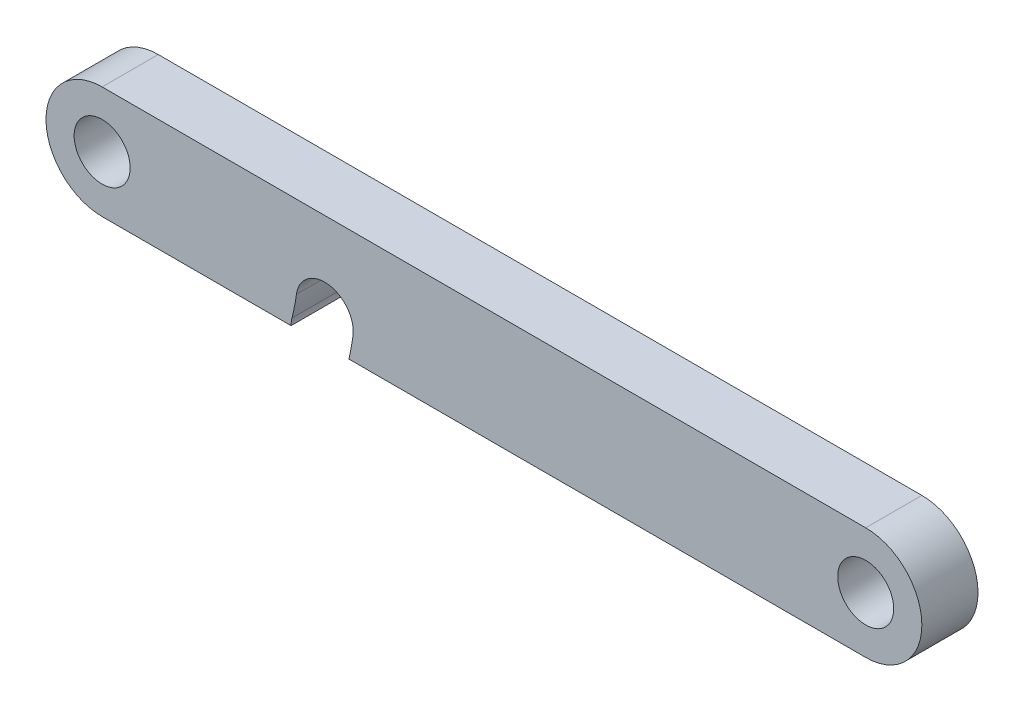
ISO-10303-21;
HEADER;
FILE_DESCRIPTION(('STEP AP214'),'2;1');
FILE_NAME('part.step','',(''),(''),'','','');
FILE_SCHEMA(('AUTOMOTIVE_DESIGN { 1 0 10303 214 1 1 1 1 }'));
ENDSEC;
DATA;
#1=APPLICATION_CONTEXT('core data for automotive mechanical design processes');
#2=APPLICATION_PROTOCOL_DEFINITION('international standard','automotive_design',2000,#1);
#3=PRODUCT_CONTEXT('',#1,'mechanical');
#4=PRODUCT('Part','Part','',(#3));
#5=PRODUCT_RELATED_PRODUCT_CATEGORY('part','',(#4));
#6=PRODUCT_DEFINITION_FORMATION('','',#4);
#7=PRODUCT_DEFINITION_CONTEXT('part definition',#1,'design');
#8=PRODUCT_DEFINITION('design','',#6,#7);
#9=PRODUCT_DEFINITION_SHAPE('','',#8);
#10=(LENGTH_UNIT() NAMED_UNIT(*) SI_UNIT(.MILLI.,.METRE.));
#11=(NAMED_UNIT(*) PLANE_ANGLE_UNIT() SI_UNIT($,.RADIAN.));
#12=(NAMED_UNIT(*) SI_UNIT($,.STERADIAN.) SOLID_ANGLE_UNIT());
#13=UNCERTAINTY_MEASURE_WITH_UNIT(LENGTH_MEASURE(1.E-05),#10,'distance_accuracy_value','');
#14=(GEOMETRIC_REPRESENTATION_CONTEXT(3) GLOBAL_UNCERTAINTY_ASSIGNED_CONTEXT((#13)) GLOBAL_UNIT_ASSIGNED_CONTEXT((#10,
#11,#12)) REPRESENTATION_CONTEXT('',''));
#15=CARTESIAN_POINT('',(0.,0.,0.));
#16=DIRECTION('',(0.,0.,1.));
#17=DIRECTION('',(1.,0.,0.));
#18=AXIS2_PLACEMENT_3D('',#15,#16,#17);
#19=CARTESIAN_POINT('',(-21.59,-3.175,1.5875));
#20=DIRECTION('',(0.,1.,0.));
#21=DIRECTION('',(0.,0.,1.));
#22=AXIS2_PLACEMENT_3D('',#19,#20,#21);
#23=PLANE('',#22);
#24=DIRECTION('',(1.,0.,0.));
#25=VECTOR('',#24,1.);
#26=CARTESIAN_POINT('',(-21.59,-3.175,-1.5875));
#27=LINE('',#26,#25);
#28=CARTESIAN_POINT('',(-21.59,-3.175,-1.5875));
#29=VERTEX_POINT('',#28);
#30=CARTESIAN_POINT('',(-10.9061778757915,-3.175,-1.5875));
#31=VERTEX_POINT('',#30);
#32=EDGE_CURVE('E178',#29,#31,#27,.T.);
#33=ORIENTED_EDGE('',*,*,#32,.T.);
#34=DIRECTION('',(0.,0.,1.));
#35=VECTOR('',#34,1.);
#36=CARTESIAN_POINT('',(-10.9061778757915,-3.175,-1.5875));
#37=LINE('',#36,#35);
#38=CARTESIAN_POINT('',(-10.9061778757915,-3.175,1.5875));
#39=VERTEX_POINT('',#38);
#40=EDGE_CURVE('E11',#31,#39,#37,.T.);
#41=ORIENTED_EDGE('',*,*,#40,.T.);
#42=DIRECTION('',(1.,0.,0.));
#43=VECTOR('',#42,1.);
#44=CARTESIAN_POINT('',(-21.59,-3.175,1.5875));
#45=LINE('',#44,#43);
#46=CARTESIAN_POINT('',(-21.59,-3.175,1.5875));
#47=VERTEX_POINT('',#46);
#48=EDGE_CURVE('E89',#47,#39,#45,.T.);
#49=ORIENTED_EDGE('',*,*,#48,.F.);
#50=DIRECTION('',(0.,0.,-1.));
#51=VECTOR('',#50,1.);
#52=CARTESIAN_POINT('',(-21.59,-3.175,1.5875));
#53=LINE('',#52,#51);
#54=EDGE_CURVE('E190',#47,#29,#53,.T.);
#55=ORIENTED_EDGE('',*,*,#54,.T.);
#56=EDGE_LOOP('',(#33,#41,#49,#55));
#57=FACE_BOUND('',#56,.T.);
#58=ADVANCED_FACE('F37',(#57),#23,.F.);
#59=CARTESIAN_POINT('',(-21.59,0.,1.5875));
#60=DIRECTION('',(0.,0.,1.));
#61=DIRECTION('',(1.,0.,0.));
#62=AXIS2_PLACEMENT_3D('',#59,#60,#61);
#63=PLANE('',#62);
#64=CARTESIAN_POINT('',(-9.29327787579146,-3.175,1.5875));
#65=DIRECTION('',(0.,0.,1.));
#66=DIRECTION('',(1.,0.,0.));
#67=AXIS2_PLACEMENT_3D('',#64,#65,#66);
#68=CIRCLE('',#67,1.6129);
#69=CARTESIAN_POINT('',(-10.8549615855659,-2.771775,1.5875));
#70=VERTEX_POINT('',#69);
#71=EDGE_CURVE('E124',#70,#39,#68,.T.);
#72=ORIENTED_EDGE('',*,*,#71,.F.);
#73=CARTESIAN_POINT('',(-21.59,0.,1.5875));
#74=DIRECTION('',(0.,0.,-1.));
#75=DIRECTION('',(1.,0.,0.));
#76=AXIS2_PLACEMENT_3D('',#73,#74,#75);
#77=CIRCLE('',#76,11.0871);
#78=CARTESIAN_POINT('',(-10.6030472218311,-1.48682717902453,1.5875));
#79=VERTEX_POINT('',#78);
#80=EDGE_CURVE('E139',#79,#70,#77,.T.);
#81=ORIENTED_EDGE('',*,*,#80,.F.);
#82=CARTESIAN_POINT('',(-9.0047161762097,-1.7031239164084,1.5875));
#83=DIRECTION('',(0.,0.,1.));
#84=DIRECTION('',(1.,0.,0.));
#85=AXIS2_PLACEMENT_3D('',#82,#83,#84);
#86=CIRCLE('',#85,1.6129);
#87=CARTESIAN_POINT('',(-7.40638513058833,-1.91942065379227,1.5875));
#88=VERTEX_POINT('',#87);
#89=EDGE_CURVE('E123',#88,#79,#86,.T.);
#90=ORIENTED_EDGE('',*,*,#89,.F.);
#91=CARTESIAN_POINT('',(-21.59,0.,1.5875));
#92=DIRECTION('',(0.,0.,1.));
#93=DIRECTION('',(1.,0.,0.));
#94=AXIS2_PLACEMENT_3D('',#91,#92,#93);
#95=CIRCLE('',#94,14.3129);
#96=CARTESIAN_POINT('',(-7.63369384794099,-3.175,1.5875));
#97=VERTEX_POINT('',#96);
#98=EDGE_CURVE('E116',#97,#88,#95,.T.);
#99=ORIENTED_EDGE('',*,*,#98,.F.);
#100=CARTESIAN_POINT('',(21.59,-3.17499999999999,1.5875));
#101=VERTEX_POINT('',#100);
#102=EDGE_CURVE('E169',#97,#101,#45,.T.);
#103=ORIENTED_EDGE('',*,*,#102,.T.);
#104=CARTESIAN_POINT('',(21.59,0.,1.5875));
#105=DIRECTION('',(0.,0.,1.));
#106=DIRECTION('',(1.,0.,0.));
#107=AXIS2_PLACEMENT_3D('',#104,#105,#106);
#108=CIRCLE('',#107,3.175);
#109=CARTESIAN_POINT('',(21.59,3.175,1.5875));
#110=VERTEX_POINT('',#109);
#111=EDGE_CURVE('E171',#101,#110,#108,.T.);
#112=ORIENTED_EDGE('',*,*,#111,.T.);
#113=DIRECTION('',(-1.,0.,0.));
#114=VECTOR('',#113,1.);
#115=CARTESIAN_POINT('',(-21.59,3.175,1.5875));
#116=LINE('',#115,#114);
#117=CARTESIAN_POINT('',(-21.59,3.175,1.5875));
#118=VERTEX_POINT('',#117);
#119=EDGE_CURVE('E61',#110,#118,#116,.T.);
#120=ORIENTED_EDGE('',*,*,#119,.T.);
#121=CARTESIAN_POINT('',(-21.59,0.,1.5875));
#122=DIRECTION('',(0.,0.,1.));
#123=DIRECTION('',(1.,0.,0.));
#124=AXIS2_PLACEMENT_3D('',#121,#122,#123);
#125=CIRCLE('',#124,3.175);
#126=EDGE_CURVE('E167',#118,#47,#125,.T.);
#127=ORIENTED_EDGE('',*,*,#126,.T.);
#128=ORIENTED_EDGE('',*,*,#48,.T.);
#129=EDGE_LOOP('',(#72,#81,#90,#99,#103,#112,#120,#127,#128));
#130=FACE_BOUND('',#129,.T.);
#131=CARTESIAN_POINT('',(21.59,0.,1.5875));
#132=DIRECTION('',(0.,0.,1.));
#133=DIRECTION('',(1.,0.,0.));
#134=AXIS2_PLACEMENT_3D('',#131,#132,#133);
#135=CIRCLE('',#134,1.584200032);
#136=CARTESIAN_POINT('',(23.174200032,0.,1.5875));
#137=VERTEX_POINT('',#136);
#138=EDGE_CURVE('E161',#137,#137,#135,.T.);
#139=ORIENTED_EDGE('',*,*,#138,.F.);
#140=EDGE_LOOP('',(#139));
#141=FACE_BOUND('',#140,.T.);
#142=CARTESIAN_POINT('',(-21.59,0.,1.5875));
#143=DIRECTION('',(0.,0.,1.));
#144=DIRECTION('',(1.,0.,0.));
#145=AXIS2_PLACEMENT_3D('',#142,#143,#144);
#146=CIRCLE('',#145,1.584200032);
#147=CARTESIAN_POINT('',(-20.005799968,0.,1.5875));
#148=VERTEX_POINT('',#147);
#149=EDGE_CURVE('E155',#148,#148,#146,.T.);
#150=ORIENTED_EDGE('',*,*,#149,.F.);
#151=EDGE_LOOP('',(#150));
#152=FACE_BOUND('',#151,.T.);
#153=ADVANCED_FACE('F136',(#130,#141,#152),#63,.T.);
#154=CARTESIAN_POINT('',(-21.59,0.,-1.5875));
#155=DIRECTION('',(0.,0.,1.));
#156=DIRECTION('',(1.,0.,0.));
#157=AXIS2_PLACEMENT_3D('',#154,#155,#156);
#158=PLANE('',#157);
#159=CARTESIAN_POINT('',(-21.59,0.,-1.5875));
#160=DIRECTION('',(0.,0.,-1.));
#161=DIRECTION('',(1.,0.,0.));
#162=AXIS2_PLACEMENT_3D('',#159,#160,#161);
#163=CIRCLE('',#162,11.0871);
#164=CARTESIAN_POINT('',(-10.6030472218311,-1.48682717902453,-1.5875));
#165=VERTEX_POINT('',#164);
#166=CARTESIAN_POINT('',(-10.8549615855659,-2.771775,-1.5875));
#167=VERTEX_POINT('',#166);
#168=EDGE_CURVE('E133',#165,#167,#163,.T.);
#169=ORIENTED_EDGE('',*,*,#168,.T.);
#170=CARTESIAN_POINT('',(-9.29327787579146,-3.175,-1.5875));
#171=DIRECTION('',(0.,0.,1.));
#172=DIRECTION('',(1.,0.,0.));
#173=AXIS2_PLACEMENT_3D('',#170,#171,#172);
#174=CIRCLE('',#173,1.6129);
#175=EDGE_CURVE('E141',#167,#31,#174,.T.);
#176=ORIENTED_EDGE('',*,*,#175,.T.);
#177=ORIENTED_EDGE('',*,*,#32,.F.);
#178=CARTESIAN_POINT('',(-21.59,0.,-1.5875));
#179=DIRECTION('',(0.,0.,1.));
#180=DIRECTION('',(1.,0.,0.));
#181=AXIS2_PLACEMENT_3D('',#178,#179,#180);
#182=CIRCLE('',#181,3.175);
#183=CARTESIAN_POINT('',(-21.59,3.175,-1.5875));
#184=VERTEX_POINT('',#183);
#185=EDGE_CURVE('E164',#184,#29,#182,.T.);
#186=ORIENTED_EDGE('',*,*,#185,.F.);
#187=DIRECTION('',(-1.,0.,0.));
#188=VECTOR('',#187,1.);
#189=CARTESIAN_POINT('',(-21.59,3.175,-1.5875));
#190=LINE('',#189,#188);
#191=CARTESIAN_POINT('',(21.59,3.175,-1.5875));
#192=VERTEX_POINT('',#191);
#193=EDGE_CURVE('E82',#192,#184,#190,.T.);
#194=ORIENTED_EDGE('',*,*,#193,.F.);
#195=CARTESIAN_POINT('',(21.59,0.,-1.5875));
#196=DIRECTION('',(0.,0.,1.));
#197=DIRECTION('',(1.,0.,0.));
#198=AXIS2_PLACEMENT_3D('',#195,#196,#197);
#199=CIRCLE('',#198,3.175);
#200=CARTESIAN_POINT('',(21.59,-3.17499999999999,-1.5875));
#201=VERTEX_POINT('',#200);
#202=EDGE_CURVE('E181',#201,#192,#199,.T.);
#203=ORIENTED_EDGE('',*,*,#202,.F.);
#204=CARTESIAN_POINT('',(-7.63369384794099,-3.175,-1.5875));
#205=VERTEX_POINT('',#204);
#206=EDGE_CURVE('E177',#205,#201,#27,.T.);
#207=ORIENTED_EDGE('',*,*,#206,.F.);
#208=CARTESIAN_POINT('',(-21.59,0.,-1.5875));
#209=DIRECTION('',(0.,0.,1.));
#210=DIRECTION('',(1.,0.,0.));
#211=AXIS2_PLACEMENT_3D('',#208,#209,#210);
#212=CIRCLE('',#211,14.3129);
#213=CARTESIAN_POINT('',(-7.40638513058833,-1.91942065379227,-1.5875));
#214=VERTEX_POINT('',#213);
#215=EDGE_CURVE('E52',#205,#214,#212,.T.);
#216=ORIENTED_EDGE('',*,*,#215,.T.);
#217=CARTESIAN_POINT('',(-9.0047161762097,-1.7031239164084,-1.5875));
#218=DIRECTION('',(0.,0.,1.));
#219=DIRECTION('',(1.,0.,0.));
#220=AXIS2_PLACEMENT_3D('',#217,#218,#219);
#221=CIRCLE('',#220,1.6129);
#222=EDGE_CURVE('E131',#214,#165,#221,.T.);
#223=ORIENTED_EDGE('',*,*,#222,.T.);
#224=EDGE_LOOP('',(#169,#176,#177,#186,#194,#203,#207,#216,#223));
#225=FACE_BOUND('',#224,.T.);
#226=CARTESIAN_POINT('',(21.59,0.,-1.5875));
#227=DIRECTION('',(0.,0.,1.));
#228=DIRECTION('',(1.,0.,0.));
#229=AXIS2_PLACEMENT_3D('',#226,#227,#228);
#230=CIRCLE('',#229,1.584200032);
#231=CARTESIAN_POINT('',(23.174200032,0.,-1.5875));
#232=VERTEX_POINT('',#231);
#233=EDGE_CURVE('E158',#232,#232,#230,.T.);
#234=ORIENTED_EDGE('',*,*,#233,.T.);
#235=EDGE_LOOP('',(#234));
#236=FACE_BOUND('',#235,.T.);
#237=CARTESIAN_POINT('',(-21.59,0.,-1.5875));
#238=DIRECTION('',(0.,0.,1.));
#239=DIRECTION('',(1.,0.,0.));
#240=AXIS2_PLACEMENT_3D('',#237,#238,#239);
#241=CIRCLE('',#240,1.584200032);
#242=CARTESIAN_POINT('',(-20.005799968,0.,-1.5875));
#243=VERTEX_POINT('',#242);
#244=EDGE_CURVE('E153',#243,#243,#241,.T.);
#245=ORIENTED_EDGE('',*,*,#244,.T.);
#246=EDGE_LOOP('',(#245));
#247=FACE_BOUND('',#246,.T.);
#248=ADVANCED_FACE('F197',(#225,#236,#247),#158,.F.);
#249=CARTESIAN_POINT('',(-21.59,0.,1.5875));
#250=DIRECTION('',(0.,0.,-1.));
#251=DIRECTION('',(-1.,0.,0.));
#252=AXIS2_PLACEMENT_3D('',#249,#250,#251);
#253=CYLINDRICAL_SURFACE('',#252,3.175);
#254=ORIENTED_EDGE('',*,*,#185,.T.);
#255=ORIENTED_EDGE('',*,*,#54,.F.);
#256=ORIENTED_EDGE('',*,*,#126,.F.);
#257=DIRECTION('',(0.,0.,-1.));
#258=VECTOR('',#257,1.);
#259=CARTESIAN_POINT('',(-21.59,3.175,1.5875));
#260=LINE('',#259,#258);
#261=EDGE_CURVE('E174',#118,#184,#260,.T.);
#262=ORIENTED_EDGE('',*,*,#261,.T.);
#263=EDGE_LOOP('',(#254,#255,#256,#262));
#264=FACE_BOUND('',#263,.T.);
#265=ADVANCED_FACE('F39',(#264),#253,.T.);
#266=ORIENTED_EDGE('',*,*,#102,.F.);
#267=DIRECTION('',(0.,0.,1.));
#268=VECTOR('',#267,1.);
#269=CARTESIAN_POINT('',(-7.63369384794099,-3.175,-1.5875));
#270=LINE('',#269,#268);
#271=EDGE_CURVE('E45',#97,#205,#270,.F.);
#272=ORIENTED_EDGE('',*,*,#271,.T.);
#273=ORIENTED_EDGE('',*,*,#206,.T.);
#274=DIRECTION('',(0.,0.,-1.));
#275=VECTOR('',#274,1.);
#276=CARTESIAN_POINT('',(21.59,-3.17499999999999,1.5875));
#277=LINE('',#276,#275);
#278=EDGE_CURVE('E187',#101,#201,#277,.T.);
#279=ORIENTED_EDGE('',*,*,#278,.F.);
#280=EDGE_LOOP('',(#266,#272,#273,#279));
#281=FACE_BOUND('',#280,.T.);
#282=ADVANCED_FACE('F193',(#281),#23,.F.);
#283=CARTESIAN_POINT('',(21.59,0.,1.5875));
#284=DIRECTION('',(0.,0.,-1.));
#285=DIRECTION('',(-1.,0.,0.));
#286=AXIS2_PLACEMENT_3D('',#283,#284,#285);
#287=CYLINDRICAL_SURFACE('',#286,3.175);
#288=ORIENTED_EDGE('',*,*,#202,.T.);
#289=DIRECTION('',(0.,0.,-1.));
#290=VECTOR('',#289,1.);
#291=CARTESIAN_POINT('',(21.59,3.175,1.5875));
#292=LINE('',#291,#290);
#293=EDGE_CURVE('E185',#110,#192,#292,.T.);
#294=ORIENTED_EDGE('',*,*,#293,.F.);
#295=ORIENTED_EDGE('',*,*,#111,.F.);
#296=ORIENTED_EDGE('',*,*,#278,.T.);
#297=EDGE_LOOP('',(#288,#294,#295,#296));
#298=FACE_BOUND('',#297,.T.);
#299=ADVANCED_FACE('F202',(#298),#287,.T.);
#300=CARTESIAN_POINT('',(-21.59,3.175,1.5875));
#301=DIRECTION('',(0.,-1.,0.));
#302=DIRECTION('',(0.,0.,-1.));
#303=AXIS2_PLACEMENT_3D('',#300,#301,#302);
#304=PLANE('',#303);
#305=ORIENTED_EDGE('',*,*,#193,.T.);
#306=ORIENTED_EDGE('',*,*,#261,.F.);
#307=ORIENTED_EDGE('',*,*,#119,.F.);
#308=ORIENTED_EDGE('',*,*,#293,.T.);
#309=EDGE_LOOP('',(#305,#306,#307,#308));
#310=FACE_BOUND('',#309,.T.);
#311=ADVANCED_FACE('F204',(#310),#304,.F.);
#312=CARTESIAN_POINT('',(21.59,0.,1.5875));
#313=DIRECTION('',(0.,0.,-1.));
#314=DIRECTION('',(-1.,0.,0.));
#315=AXIS2_PLACEMENT_3D('',#312,#313,#314);
#316=CYLINDRICAL_SURFACE('',#315,1.584200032);
#317=ORIENTED_EDGE('',*,*,#138,.T.);
#318=EDGE_LOOP('',(#317));
#319=FACE_BOUND('',#318,.T.);
#320=ORIENTED_EDGE('',*,*,#233,.F.);
#321=EDGE_LOOP('',(#320));
#322=FACE_BOUND('',#321,.T.);
#323=ADVANCED_FACE('F242',(#319,#322),#316,.F.);
#324=CARTESIAN_POINT('',(-21.59,0.,1.5875));
#325=DIRECTION('',(0.,0.,-1.));
#326=DIRECTION('',(-1.,0.,0.));
#327=AXIS2_PLACEMENT_3D('',#324,#325,#326);
#328=CYLINDRICAL_SURFACE('',#327,1.584200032);
#329=ORIENTED_EDGE('',*,*,#149,.T.);
#330=EDGE_LOOP('',(#329));
#331=FACE_BOUND('',#330,.T.);
#332=ORIENTED_EDGE('',*,*,#244,.F.);
#333=EDGE_LOOP('',(#332));
#334=FACE_BOUND('',#333,.T.);
#335=ADVANCED_FACE('F246',(#331,#334),#328,.F.);
#336=CARTESIAN_POINT('',(-9.29327787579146,-3.175,-1.5875));
#337=DIRECTION('',(0.,0.,1.));
#338=DIRECTION('',(1.,0.,0.));
#339=AXIS2_PLACEMENT_3D('',#336,#337,#338);
#340=CYLINDRICAL_SURFACE('',#339,1.6129);
#341=ORIENTED_EDGE('',*,*,#175,.F.);
#342=DIRECTION('',(0.,0.,1.));
#343=VECTOR('',#342,1.);
#344=CARTESIAN_POINT('',(-10.8549615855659,-2.771775,-1.5875));
#345=LINE('',#344,#343);
#346=EDGE_CURVE('E151',#167,#70,#345,.T.);
#347=ORIENTED_EDGE('',*,*,#346,.T.);
#348=ORIENTED_EDGE('',*,*,#71,.T.);
#349=ORIENTED_EDGE('',*,*,#40,.F.);
#350=EDGE_LOOP('',(#341,#347,#348,#349));
#351=FACE_BOUND('',#350,.T.);
#352=ADVANCED_FACE('F210',(#351),#340,.F.);
#353=CARTESIAN_POINT('',(-21.59,0.,-1.5875));
#354=DIRECTION('',(0.,0.,1.));
#355=DIRECTION('',(1.,0.,0.));
#356=AXIS2_PLACEMENT_3D('',#353,#354,#355);
#357=CYLINDRICAL_SURFACE('',#356,14.3129);
#358=ORIENTED_EDGE('',*,*,#98,.T.);
#359=DIRECTION('',(0.,0.,1.));
#360=VECTOR('',#359,1.);
#361=CARTESIAN_POINT('',(-7.40638513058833,-1.91942065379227,-1.5875));
#362=LINE('',#361,#360);
#363=EDGE_CURVE('E119',#214,#88,#362,.T.);
#364=ORIENTED_EDGE('',*,*,#363,.F.);
#365=ORIENTED_EDGE('',*,*,#215,.F.);
#366=ORIENTED_EDGE('',*,*,#271,.F.);
#367=EDGE_LOOP('',(#358,#364,#365,#366));
#368=FACE_BOUND('',#367,.T.);
#369=ADVANCED_FACE('F118',(#368),#357,.F.);
#370=CARTESIAN_POINT('',(-21.59,0.,-1.5875));
#371=DIRECTION('',(0.,0.,1.));
#372=DIRECTION('',(1.,0.,0.));
#373=AXIS2_PLACEMENT_3D('',#370,#371,#372);
#374=CYLINDRICAL_SURFACE('',#373,11.0871);
#375=ORIENTED_EDGE('',*,*,#346,.F.);
#376=ORIENTED_EDGE('',*,*,#168,.F.);
#377=DIRECTION('',(0.,0.,1.));
#378=VECTOR('',#377,1.);
#379=CARTESIAN_POINT('',(-10.6030472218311,-1.48682717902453,-1.5875));
#380=LINE('',#379,#378);
#381=EDGE_CURVE('E132',#165,#79,#380,.T.);
#382=ORIENTED_EDGE('',*,*,#381,.T.);
#383=ORIENTED_EDGE('',*,*,#80,.T.);
#384=EDGE_LOOP('',(#375,#376,#382,#383));
#385=FACE_BOUND('',#384,.T.);
#386=ADVANCED_FACE('F213',(#385),#374,.T.);
#387=CARTESIAN_POINT('',(-9.0047161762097,-1.7031239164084,-1.5875));
#388=DIRECTION('',(0.,0.,1.));
#389=DIRECTION('',(1.,0.,0.));
#390=AXIS2_PLACEMENT_3D('',#387,#388,#389);
#391=CYLINDRICAL_SURFACE('',#390,1.6129);
#392=ORIENTED_EDGE('',*,*,#381,.F.);
#393=ORIENTED_EDGE('',*,*,#222,.F.);
#394=ORIENTED_EDGE('',*,*,#363,.T.);
#395=ORIENTED_EDGE('',*,*,#89,.T.);
#396=EDGE_LOOP('',(#392,#393,#394,#395));
#397=FACE_BOUND('',#396,.T.);
#398=ADVANCED_FACE('F128',(#397),#391,.F.);
#399=CLOSED_SHELL('',(#58,#153,#248,#265,#282,#299,#311,#323,#335,#352,#369,#386,#398));
#400=MANIFOLD_SOLID_BREP('B2',#399);
#401=ADVANCED_BREP_SHAPE_REPRESENTATION('',(#18,#400),#14);
#402=SHAPE_DEFINITION_REPRESENTATION(#9,#401);
ENDSEC;
END-ISO-10303-21;
